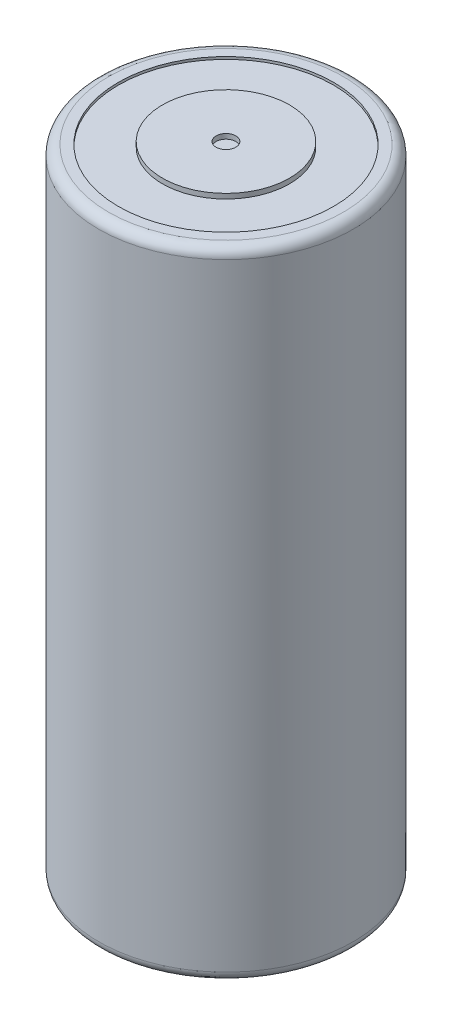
ISO-10303-21;
HEADER;
FILE_DESCRIPTION(('STEP AP214'),'2;1');
FILE_NAME('part.step','',(''),(''),'','','');
FILE_SCHEMA(('AUTOMOTIVE_DESIGN { 1 0 10303 214 1 1 1 1 }'));
ENDSEC;
DATA;
#1=APPLICATION_CONTEXT('core data for automotive mechanical design processes');
#2=APPLICATION_PROTOCOL_DEFINITION('international standard','automotive_design',2000,#1);
#3=PRODUCT_CONTEXT('',#1,'mechanical');
#4=PRODUCT('Part','Part','',(#3));
#5=PRODUCT_RELATED_PRODUCT_CATEGORY('part','',(#4));
#6=PRODUCT_DEFINITION_FORMATION('','',#4);
#7=PRODUCT_DEFINITION_CONTEXT('part definition',#1,'design');
#8=PRODUCT_DEFINITION('design','',#6,#7);
#9=PRODUCT_DEFINITION_SHAPE('','',#8);
#10=(LENGTH_UNIT() NAMED_UNIT(*) SI_UNIT(.MILLI.,.METRE.));
#11=(NAMED_UNIT(*) PLANE_ANGLE_UNIT() SI_UNIT($,.RADIAN.));
#12=(NAMED_UNIT(*) SI_UNIT($,.STERADIAN.) SOLID_ANGLE_UNIT());
#13=UNCERTAINTY_MEASURE_WITH_UNIT(LENGTH_MEASURE(1.E-05),#10,'distance_accuracy_value','');
#14=(GEOMETRIC_REPRESENTATION_CONTEXT(3) GLOBAL_UNCERTAINTY_ASSIGNED_CONTEXT((#13)) GLOBAL_UNIT_ASSIGNED_CONTEXT((#10,
#11,#12)) REPRESENTATION_CONTEXT('',''));
#15=CARTESIAN_POINT('',(0.,0.,0.));
#16=DIRECTION('',(0.,0.,1.));
#17=DIRECTION('',(1.,0.,0.));
#18=AXIS2_PLACEMENT_3D('',#15,#16,#17);
#19=CARTESIAN_POINT('',(1.,-0.5,0.));
#20=DIRECTION('',(0.,1.,0.));
#21=DIRECTION('',(0.,0.,1.));
#22=AXIS2_PLACEMENT_3D('',#19,#20,#21);
#23=PLANE('',#22);
#24=CARTESIAN_POINT('',(0.,-0.5,0.));
#25=DIRECTION('',(0.,-1.,0.));
#26=DIRECTION('',(0.,0.,-1.));
#27=AXIS2_PLACEMENT_3D('',#24,#25,#26);
#28=CIRCLE('',#27,1.);
#29=CARTESIAN_POINT('',(0.,-0.5,-1.));
#30=VERTEX_POINT('',#29);
#31=EDGE_CURVE('E52',#30,#30,#28,.T.);
#32=ORIENTED_EDGE('',*,*,#31,.F.);
#33=EDGE_LOOP('',(#32));
#34=FACE_BOUND('',#33,.T.);
#35=ADVANCED_FACE('F32',(#34),#23,.T.);
#36=CARTESIAN_POINT('',(0.,-65.15,0.));
#37=DIRECTION('',(0.,-1.,0.));
#38=DIRECTION('',(0.,0.,-1.));
#39=AXIS2_PLACEMENT_3D('',#36,#37,#38);
#40=CYLINDRICAL_SURFACE('',#39,1.);
#41=ORIENTED_EDGE('',*,*,#31,.T.);
#42=EDGE_LOOP('',(#41));
#43=FACE_BOUND('',#42,.T.);
#44=CARTESIAN_POINT('',(0.,0.,0.));
#45=DIRECTION('',(0.,-1.,0.));
#46=DIRECTION('',(0.,0.,-1.));
#47=AXIS2_PLACEMENT_3D('',#44,#45,#46);
#48=CIRCLE('',#47,1.);
#49=CARTESIAN_POINT('',(0.,0.,-1.));
#50=VERTEX_POINT('',#49);
#51=EDGE_CURVE('E55',#50,#50,#48,.T.);
#52=ORIENTED_EDGE('',*,*,#51,.F.);
#53=EDGE_LOOP('',(#52));
#54=FACE_BOUND('',#53,.T.);
#55=ADVANCED_FACE('F100',(#43,#54),#40,.F.);
#56=CARTESIAN_POINT('',(1.,0.,0.));
#57=DIRECTION('',(0.,1.,0.));
#58=DIRECTION('',(0.,0.,1.));
#59=AXIS2_PLACEMENT_3D('',#56,#57,#58);
#60=PLANE('',#59);
#61=ORIENTED_EDGE('',*,*,#51,.T.);
#62=EDGE_LOOP('',(#61));
#63=FACE_BOUND('',#62,.T.);
#64=CARTESIAN_POINT('',(0.,0.,0.));
#65=DIRECTION('',(0.,-1.,0.));
#66=DIRECTION('',(0.,0.,-1.));
#67=AXIS2_PLACEMENT_3D('',#64,#65,#66);
#68=CIRCLE('',#67,6.45);
#69=CARTESIAN_POINT('',(0.,0.,-6.45));
#70=VERTEX_POINT('',#69);
#71=EDGE_CURVE('E58',#70,#70,#68,.T.);
#72=ORIENTED_EDGE('',*,*,#71,.F.);
#73=EDGE_LOOP('',(#72));
#74=FACE_BOUND('',#73,.T.);
#75=ADVANCED_FACE('F106',(#63,#74),#60,.T.);
#76=CARTESIAN_POINT('',(0.,-65.15,0.));
#77=DIRECTION('',(0.,-1.,0.));
#78=DIRECTION('',(0.,0.,-1.));
#79=AXIS2_PLACEMENT_3D('',#76,#77,#78);
#80=CYLINDRICAL_SURFACE('',#79,6.45);
#81=ORIENTED_EDGE('',*,*,#71,.T.);
#82=EDGE_LOOP('',(#81));
#83=FACE_BOUND('',#82,.T.);
#84=CARTESIAN_POINT('',(0.,-0.5,0.));
#85=DIRECTION('',(0.,-1.,0.));
#86=DIRECTION('',(0.,0.,-1.));
#87=AXIS2_PLACEMENT_3D('',#84,#85,#86);
#88=CIRCLE('',#87,6.45);
#89=CARTESIAN_POINT('',(0.,-0.5,-6.45));
#90=VERTEX_POINT('',#89);
#91=EDGE_CURVE('E61',#90,#90,#88,.T.);
#92=ORIENTED_EDGE('',*,*,#91,.F.);
#93=EDGE_LOOP('',(#92));
#94=FACE_BOUND('',#93,.T.);
#95=ADVANCED_FACE('F148',(#83,#94),#80,.T.);
#96=CARTESIAN_POINT('',(6.45,-0.5,0.));
#97=DIRECTION('',(0.,1.,0.));
#98=DIRECTION('',(0.,0.,1.));
#99=AXIS2_PLACEMENT_3D('',#96,#97,#98);
#100=PLANE('',#99);
#101=ORIENTED_EDGE('',*,*,#91,.T.);
#102=EDGE_LOOP('',(#101));
#103=FACE_BOUND('',#102,.T.);
#104=CARTESIAN_POINT('',(0.,-0.5,0.));
#105=DIRECTION('',(0.,-1.,0.));
#106=DIRECTION('',(0.,0.,-1.));
#107=AXIS2_PLACEMENT_3D('',#104,#105,#106);
#108=CIRCLE('',#107,10.925);
#109=CARTESIAN_POINT('',(0.,-0.5,-10.925));
#110=VERTEX_POINT('',#109);
#111=EDGE_CURVE('E64',#110,#110,#108,.T.);
#112=ORIENTED_EDGE('',*,*,#111,.F.);
#113=EDGE_LOOP('',(#112));
#114=FACE_BOUND('',#113,.T.);
#115=ADVANCED_FACE('F144',(#103,#114),#100,.T.);
#116=CARTESIAN_POINT('',(0.,-65.15,0.));
#117=DIRECTION('',(0.,-1.,0.));
#118=DIRECTION('',(0.,0.,-1.));
#119=AXIS2_PLACEMENT_3D('',#116,#117,#118);
#120=CYLINDRICAL_SURFACE('',#119,10.925);
#121=ORIENTED_EDGE('',*,*,#111,.T.);
#122=EDGE_LOOP('',(#121));
#123=FACE_BOUND('',#122,.T.);
#124=CARTESIAN_POINT('',(0.,-0.25,0.));
#125=DIRECTION('',(0.,-1.,0.));
#126=DIRECTION('',(0.,0.,-1.));
#127=AXIS2_PLACEMENT_3D('',#124,#125,#126);
#128=CIRCLE('',#127,10.925);
#129=CARTESIAN_POINT('',(0.,-0.25,-10.925));
#130=VERTEX_POINT('',#129);
#131=EDGE_CURVE('E67',#130,#130,#128,.T.);
#132=ORIENTED_EDGE('',*,*,#131,.F.);
#133=EDGE_LOOP('',(#132));
#134=FACE_BOUND('',#133,.T.);
#135=ADVANCED_FACE('F141',(#123,#134),#120,.F.);
#136=CARTESIAN_POINT('',(12.925,-0.25,0.));
#137=DIRECTION('',(0.,1.,0.));
#138=DIRECTION('',(0.,0.,1.));
#139=AXIS2_PLACEMENT_3D('',#136,#137,#138);
#140=PLANE('',#139);
#141=CARTESIAN_POINT('',(0.,-0.25,0.));
#142=DIRECTION('',(0.,1.,0.));
#143=DIRECTION('',(0.,0.,1.));
#144=AXIS2_PLACEMENT_3D('',#141,#142,#143);
#145=CIRCLE('',#144,11.925);
#146=CARTESIAN_POINT('',(0.,-0.25,11.925));
#147=VERTEX_POINT('',#146);
#148=EDGE_CURVE('E10',#147,#147,#145,.T.);
#149=ORIENTED_EDGE('',*,*,#148,.T.);
#150=EDGE_LOOP('',(#149));
#151=FACE_BOUND('',#150,.T.);
#152=ORIENTED_EDGE('',*,*,#131,.T.);
#153=EDGE_LOOP('',(#152));
#154=FACE_BOUND('',#153,.T.);
#155=ADVANCED_FACE('F138',(#151,#154),#140,.T.);
#156=CARTESIAN_POINT('',(0.,-65.15,0.));
#157=DIRECTION('',(0.,-1.,0.));
#158=DIRECTION('',(0.,0.,-1.));
#159=AXIS2_PLACEMENT_3D('',#156,#157,#158);
#160=CYLINDRICAL_SURFACE('',#159,12.925);
#161=CARTESIAN_POINT('',(0.,-63.9,0.));
#162=DIRECTION('',(0.,-1.,0.));
#163=DIRECTION('',(0.,0.,-1.));
#164=AXIS2_PLACEMENT_3D('',#161,#162,#163);
#165=CIRCLE('',#164,12.925);
#166=CARTESIAN_POINT('',(0.,-63.9,-12.925));
#167=VERTEX_POINT('',#166);
#168=EDGE_CURVE('E39',#167,#167,#165,.F.);
#169=ORIENTED_EDGE('',*,*,#168,.T.);
#170=EDGE_LOOP('',(#169));
#171=FACE_BOUND('',#170,.T.);
#172=CARTESIAN_POINT('',(0.,-1.25,0.));
#173=DIRECTION('',(0.,1.,0.));
#174=DIRECTION('',(0.,0.,1.));
#175=AXIS2_PLACEMENT_3D('',#172,#173,#174);
#176=CIRCLE('',#175,12.925);
#177=CARTESIAN_POINT('',(0.,-1.25,12.925));
#178=VERTEX_POINT('',#177);
#179=EDGE_CURVE('E43',#178,#178,#176,.F.);
#180=ORIENTED_EDGE('',*,*,#179,.T.);
#181=EDGE_LOOP('',(#180));
#182=FACE_BOUND('',#181,.T.);
#183=ADVANCED_FACE('F123',(#171,#182),#160,.T.);
#184=CARTESIAN_POINT('',(10.925,-64.9,0.));
#185=DIRECTION('',(0.,-1.,0.));
#186=DIRECTION('',(0.,0.,-1.));
#187=AXIS2_PLACEMENT_3D('',#184,#185,#186);
#188=PLANE('',#187);
#189=CARTESIAN_POINT('',(0.,-64.9,0.));
#190=DIRECTION('',(0.,-1.,0.));
#191=DIRECTION('',(0.,0.,-1.));
#192=AXIS2_PLACEMENT_3D('',#189,#190,#191);
#193=CIRCLE('',#192,11.925);
#194=CARTESIAN_POINT('',(0.,-64.9,-11.925));
#195=VERTEX_POINT('',#194);
#196=EDGE_CURVE('E47',#195,#195,#193,.T.);
#197=ORIENTED_EDGE('',*,*,#196,.T.);
#198=EDGE_LOOP('',(#197));
#199=FACE_BOUND('',#198,.T.);
#200=CARTESIAN_POINT('',(0.,-64.9,0.));
#201=DIRECTION('',(0.,-1.,0.));
#202=DIRECTION('',(0.,0.,-1.));
#203=AXIS2_PLACEMENT_3D('',#200,#201,#202);
#204=CIRCLE('',#203,10.925);
#205=CARTESIAN_POINT('',(0.,-64.9,-10.925));
#206=VERTEX_POINT('',#205);
#207=EDGE_CURVE('E70',#206,#206,#204,.T.);
#208=ORIENTED_EDGE('',*,*,#207,.F.);
#209=EDGE_LOOP('',(#208));
#210=FACE_BOUND('',#209,.T.);
#211=ADVANCED_FACE('F120',(#199,#210),#188,.T.);
#212=CARTESIAN_POINT('',(0.,-65.15,0.));
#213=DIRECTION('',(0.,-1.,0.));
#214=DIRECTION('',(0.,0.,-1.));
#215=AXIS2_PLACEMENT_3D('',#212,#213,#214);
#216=CYLINDRICAL_SURFACE('',#215,10.925);
#217=ORIENTED_EDGE('',*,*,#207,.T.);
#218=EDGE_LOOP('',(#217));
#219=FACE_BOUND('',#218,.T.);
#220=CARTESIAN_POINT('',(0.,-64.65,0.));
#221=DIRECTION('',(0.,-1.,0.));
#222=DIRECTION('',(0.,0.,-1.));
#223=AXIS2_PLACEMENT_3D('',#220,#221,#222);
#224=CIRCLE('',#223,10.925);
#225=CARTESIAN_POINT('',(0.,-64.65,-10.925));
#226=VERTEX_POINT('',#225);
#227=EDGE_CURVE('E73',#226,#226,#224,.T.);
#228=ORIENTED_EDGE('',*,*,#227,.F.);
#229=EDGE_LOOP('',(#228));
#230=FACE_BOUND('',#229,.T.);
#231=ADVANCED_FACE('F96',(#219,#230),#216,.F.);
#232=CARTESIAN_POINT('',(10.925,-64.65,0.));
#233=DIRECTION('',(0.,-1.,0.));
#234=DIRECTION('',(0.,0.,-1.));
#235=AXIS2_PLACEMENT_3D('',#232,#233,#234);
#236=PLANE('',#235);
#237=ORIENTED_EDGE('',*,*,#227,.T.);
#238=EDGE_LOOP('',(#237));
#239=FACE_BOUND('',#238,.T.);
#240=CARTESIAN_POINT('',(0.,-64.65,0.));
#241=DIRECTION('',(0.,-1.,0.));
#242=DIRECTION('',(0.,0.,-1.));
#243=AXIS2_PLACEMENT_3D('',#240,#241,#242);
#244=CIRCLE('',#243,7.5);
#245=CARTESIAN_POINT('',(0.,-64.65,-7.5));
#246=VERTEX_POINT('',#245);
#247=EDGE_CURVE('E76',#246,#246,#244,.T.);
#248=ORIENTED_EDGE('',*,*,#247,.F.);
#249=EDGE_LOOP('',(#248));
#250=FACE_BOUND('',#249,.T.);
#251=ADVANCED_FACE('F87',(#239,#250),#236,.T.);
#252=CARTESIAN_POINT('',(0.,-65.15,0.));
#253=DIRECTION('',(0.,-1.,0.));
#254=DIRECTION('',(0.,0.,-1.));
#255=AXIS2_PLACEMENT_3D('',#252,#253,#254);
#256=CYLINDRICAL_SURFACE('',#255,7.5);
#257=ORIENTED_EDGE('',*,*,#247,.T.);
#258=EDGE_LOOP('',(#257));
#259=FACE_BOUND('',#258,.T.);
#260=CARTESIAN_POINT('',(0.,-65.15,0.));
#261=DIRECTION('',(0.,-1.,0.));
#262=DIRECTION('',(0.,0.,-1.));
#263=AXIS2_PLACEMENT_3D('',#260,#261,#262);
#264=CIRCLE('',#263,7.5);
#265=CARTESIAN_POINT('',(0.,-65.15,-7.5));
#266=VERTEX_POINT('',#265);
#267=EDGE_CURVE('E79',#266,#266,#264,.T.);
#268=ORIENTED_EDGE('',*,*,#267,.F.);
#269=EDGE_LOOP('',(#268));
#270=FACE_BOUND('',#269,.T.);
#271=ADVANCED_FACE('F85',(#259,#270),#256,.T.);
#272=CARTESIAN_POINT('',(7.5,-65.15,0.));
#273=DIRECTION('',(0.,-1.,0.));
#274=DIRECTION('',(0.,0.,-1.));
#275=AXIS2_PLACEMENT_3D('',#272,#273,#274);
#276=PLANE('',#275);
#277=ORIENTED_EDGE('',*,*,#267,.T.);
#278=EDGE_LOOP('',(#277));
#279=FACE_BOUND('',#278,.T.);
#280=ADVANCED_FACE('F83',(#279),#276,.T.);
#281=CARTESIAN_POINT('',(0.,-63.9,0.));
#282=DIRECTION('',(0.,-1.,0.));
#283=DIRECTION('',(0.,0.,-1.));
#284=AXIS2_PLACEMENT_3D('',#281,#282,#283);
#285=TOROIDAL_SURFACE('',#284,11.925,1.);
#286=ORIENTED_EDGE('',*,*,#168,.F.);
#287=EDGE_LOOP('',(#286));
#288=FACE_BOUND('',#287,.T.);
#289=ORIENTED_EDGE('',*,*,#196,.F.);
#290=EDGE_LOOP('',(#289));
#291=FACE_BOUND('',#290,.T.);
#292=ADVANCED_FACE('F94',(#288,#291),#285,.T.);
#293=CARTESIAN_POINT('',(0.,-1.25,0.));
#294=DIRECTION('',(0.,1.,0.));
#295=DIRECTION('',(0.,0.,1.));
#296=AXIS2_PLACEMENT_3D('',#293,#294,#295);
#297=TOROIDAL_SURFACE('',#296,11.925,1.);
#298=ORIENTED_EDGE('',*,*,#148,.F.);
#299=EDGE_LOOP('',(#298));
#300=FACE_BOUND('',#299,.T.);
#301=ORIENTED_EDGE('',*,*,#179,.F.);
#302=EDGE_LOOP('',(#301));
#303=FACE_BOUND('',#302,.T.);
#304=ADVANCED_FACE('F34',(#300,#303),#297,.T.);
#305=CLOSED_SHELL('',(#35,#55,#75,#95,#115,#135,#155,#183,#211,#231,#251,#271,#280,#292,#304));
#306=MANIFOLD_SOLID_BREP('B2',#305);
#307=ADVANCED_BREP_SHAPE_REPRESENTATION('',(#18,#306),#14);
#308=SHAPE_DEFINITION_REPRESENTATION(#9,#307);
ENDSEC;
END-ISO-10303-21;
